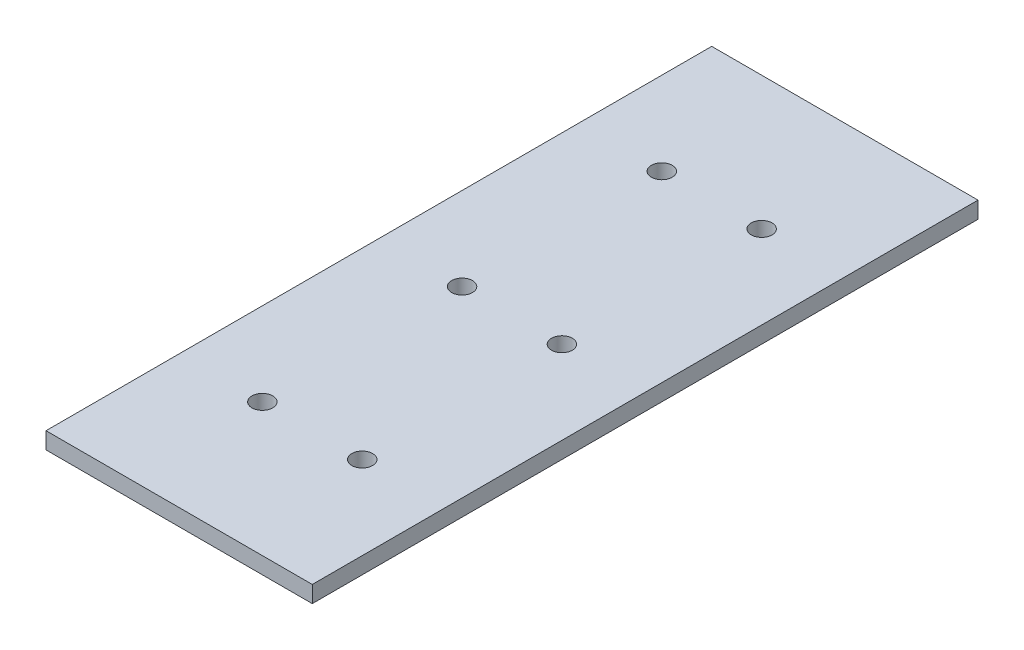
ISO-10303-21;
HEADER;
FILE_DESCRIPTION(('STEP AP214'),'2;1');
FILE_NAME('part.step','',(''),(''),'','','');
FILE_SCHEMA(('AUTOMOTIVE_DESIGN { 1 0 10303 214 1 1 1 1 }'));
ENDSEC;
DATA;
#1=APPLICATION_CONTEXT('core data for automotive mechanical design processes');
#2=APPLICATION_PROTOCOL_DEFINITION('international standard','automotive_design',2000,#1);
#3=PRODUCT_CONTEXT('',#1,'mechanical');
#4=PRODUCT('Part','Part','',(#3));
#5=PRODUCT_RELATED_PRODUCT_CATEGORY('part','',(#4));
#6=PRODUCT_DEFINITION_FORMATION('','',#4);
#7=PRODUCT_DEFINITION_CONTEXT('part definition',#1,'design');
#8=PRODUCT_DEFINITION('design','',#6,#7);
#9=PRODUCT_DEFINITION_SHAPE('','',#8);
#10=(LENGTH_UNIT() NAMED_UNIT(*) SI_UNIT(.MILLI.,.METRE.));
#11=(NAMED_UNIT(*) PLANE_ANGLE_UNIT() SI_UNIT($,.RADIAN.));
#12=(NAMED_UNIT(*) SI_UNIT($,.STERADIAN.) SOLID_ANGLE_UNIT());
#13=UNCERTAINTY_MEASURE_WITH_UNIT(LENGTH_MEASURE(1.E-05),#10,'distance_accuracy_value','');
#14=(GEOMETRIC_REPRESENTATION_CONTEXT(3) GLOBAL_UNCERTAINTY_ASSIGNED_CONTEXT((#13)) GLOBAL_UNIT_ASSIGNED_CONTEXT((#10,
#11,#12)) REPRESENTATION_CONTEXT('',''));
#15=CARTESIAN_POINT('',(0.,0.,0.));
#16=DIRECTION('',(0.,0.,1.));
#17=DIRECTION('',(1.,0.,0.));
#18=AXIS2_PLACEMENT_3D('',#15,#16,#17);
#19=CARTESIAN_POINT('',(-50.8,-3.17500000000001,254.));
#20=DIRECTION('',(1.,0.,0.));
#21=DIRECTION('',(0.,0.,-1.));
#22=AXIS2_PLACEMENT_3D('',#19,#20,#21);
#23=PLANE('',#22);
#24=DIRECTION('',(0.,-1.,0.));
#25=VECTOR('',#24,1.);
#26=CARTESIAN_POINT('',(-50.8,-3.17500000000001,0.));
#27=LINE('',#26,#25);
#28=CARTESIAN_POINT('',(-50.8,3.17499999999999,0.));
#29=VERTEX_POINT('',#28);
#30=CARTESIAN_POINT('',(-50.8,-3.17500000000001,0.));
#31=VERTEX_POINT('',#30);
#32=EDGE_CURVE('E95',#29,#31,#27,.T.);
#33=ORIENTED_EDGE('',*,*,#32,.T.);
#34=DIRECTION('',(0.,0.,-1.));
#35=VECTOR('',#34,1.);
#36=CARTESIAN_POINT('',(-50.8,-3.17500000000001,254.));
#37=LINE('',#36,#35);
#38=CARTESIAN_POINT('',(-50.8,-3.17500000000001,254.));
#39=VERTEX_POINT('',#38);
#40=EDGE_CURVE('E11',#39,#31,#37,.T.);
#41=ORIENTED_EDGE('',*,*,#40,.F.);
#42=DIRECTION('',(0.,-1.,0.));
#43=VECTOR('',#42,1.);
#44=CARTESIAN_POINT('',(-50.8,-3.17500000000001,254.));
#45=LINE('',#44,#43);
#46=CARTESIAN_POINT('',(-50.8,3.17499999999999,254.));
#47=VERTEX_POINT('',#46);
#48=EDGE_CURVE('E83',#47,#39,#45,.T.);
#49=ORIENTED_EDGE('',*,*,#48,.F.);
#50=DIRECTION('',(0.,0.,-1.));
#51=VECTOR('',#50,1.);
#52=CARTESIAN_POINT('',(-50.8,3.17499999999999,254.));
#53=LINE('',#52,#51);
#54=EDGE_CURVE('E91',#47,#29,#53,.T.);
#55=ORIENTED_EDGE('',*,*,#54,.T.);
#56=EDGE_LOOP('',(#33,#41,#49,#55));
#57=FACE_BOUND('',#56,.T.);
#58=ADVANCED_FACE('F32',(#57),#23,.F.);
#59=CARTESIAN_POINT('',(50.8,-3.17499999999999,254.));
#60=DIRECTION('',(0.,1.,0.));
#61=DIRECTION('',(-1.,0.,0.));
#62=AXIS2_PLACEMENT_3D('',#59,#60,#61);
#63=PLANE('',#62);
#64=CARTESIAN_POINT('',(19.05,-3.175,203.2));
#65=DIRECTION('',(0.,1.,0.));
#66=DIRECTION('',(-1.,0.,0.));
#67=AXIS2_PLACEMENT_3D('',#64,#65,#66);
#68=CIRCLE('',#67,3.97510000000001);
#69=CARTESIAN_POINT('',(15.0749,-3.175,203.2));
#70=VERTEX_POINT('',#69);
#71=EDGE_CURVE('E136',#70,#70,#68,.T.);
#72=ORIENTED_EDGE('',*,*,#71,.T.);
#73=EDGE_LOOP('',(#72));
#74=FACE_BOUND('',#73,.T.);
#75=CARTESIAN_POINT('',(-19.05,-3.175,203.2));
#76=DIRECTION('',(0.,1.,0.));
#77=DIRECTION('',(-1.,0.,0.));
#78=AXIS2_PLACEMENT_3D('',#75,#76,#77);
#79=CIRCLE('',#78,3.97510000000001);
#80=CARTESIAN_POINT('',(-23.0251,-3.175,203.2));
#81=VERTEX_POINT('',#80);
#82=EDGE_CURVE('E130',#81,#81,#79,.T.);
#83=ORIENTED_EDGE('',*,*,#82,.T.);
#84=EDGE_LOOP('',(#83));
#85=FACE_BOUND('',#84,.T.);
#86=CARTESIAN_POINT('',(19.05,-3.175,127.));
#87=DIRECTION('',(0.,1.,0.));
#88=DIRECTION('',(-1.,0.,0.));
#89=AXIS2_PLACEMENT_3D('',#86,#87,#88);
#90=CIRCLE('',#89,3.97510000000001);
#91=CARTESIAN_POINT('',(15.0749,-3.175,127.));
#92=VERTEX_POINT('',#91);
#93=EDGE_CURVE('E124',#92,#92,#90,.T.);
#94=ORIENTED_EDGE('',*,*,#93,.T.);
#95=EDGE_LOOP('',(#94));
#96=FACE_BOUND('',#95,.T.);
#97=CARTESIAN_POINT('',(-19.05,-3.175,127.));
#98=DIRECTION('',(0.,1.,0.));
#99=DIRECTION('',(-1.,0.,0.));
#100=AXIS2_PLACEMENT_3D('',#97,#98,#99);
#101=CIRCLE('',#100,3.97510000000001);
#102=CARTESIAN_POINT('',(-23.0251,-3.175,127.));
#103=VERTEX_POINT('',#102);
#104=EDGE_CURVE('E118',#103,#103,#101,.T.);
#105=ORIENTED_EDGE('',*,*,#104,.T.);
#106=EDGE_LOOP('',(#105));
#107=FACE_BOUND('',#106,.T.);
#108=CARTESIAN_POINT('',(19.05,-3.175,50.8));
#109=DIRECTION('',(0.,1.,0.));
#110=DIRECTION('',(-1.,0.,0.));
#111=AXIS2_PLACEMENT_3D('',#108,#109,#110);
#112=CIRCLE('',#111,3.9751);
#113=CARTESIAN_POINT('',(15.0749,-3.175,50.8));
#114=VERTEX_POINT('',#113);
#115=EDGE_CURVE('E112',#114,#114,#112,.T.);
#116=ORIENTED_EDGE('',*,*,#115,.T.);
#117=EDGE_LOOP('',(#116));
#118=FACE_BOUND('',#117,.T.);
#119=CARTESIAN_POINT('',(-19.05,-3.175,50.8));
#120=DIRECTION('',(0.,1.,0.));
#121=DIRECTION('',(-1.,0.,0.));
#122=AXIS2_PLACEMENT_3D('',#119,#120,#121);
#123=CIRCLE('',#122,3.9751);
#124=CARTESIAN_POINT('',(-23.0251,-3.175,50.8));
#125=VERTEX_POINT('',#124);
#126=EDGE_CURVE('E98',#125,#125,#123,.T.);
#127=ORIENTED_EDGE('',*,*,#126,.T.);
#128=EDGE_LOOP('',(#127));
#129=FACE_BOUND('',#128,.T.);
#130=DIRECTION('',(1.,0.,0.));
#131=VECTOR('',#130,1.);
#132=CARTESIAN_POINT('',(50.8,-3.17499999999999,0.));
#133=LINE('',#132,#131);
#134=CARTESIAN_POINT('',(50.8,-3.17499999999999,0.));
#135=VERTEX_POINT('',#134);
#136=EDGE_CURVE('E87',#31,#135,#133,.T.);
#137=ORIENTED_EDGE('',*,*,#136,.T.);
#138=DIRECTION('',(0.,0.,-1.));
#139=VECTOR('',#138,1.);
#140=CARTESIAN_POINT('',(50.8,-3.17499999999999,254.));
#141=LINE('',#140,#139);
#142=CARTESIAN_POINT('',(50.8,-3.17499999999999,254.));
#143=VERTEX_POINT('',#142);
#144=EDGE_CURVE('E40',#143,#135,#141,.T.);
#145=ORIENTED_EDGE('',*,*,#144,.F.);
#146=DIRECTION('',(1.,0.,0.));
#147=VECTOR('',#146,1.);
#148=CARTESIAN_POINT('',(50.8,-3.17499999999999,254.));
#149=LINE('',#148,#147);
#150=EDGE_CURVE('E78',#39,#143,#149,.T.);
#151=ORIENTED_EDGE('',*,*,#150,.F.);
#152=ORIENTED_EDGE('',*,*,#40,.T.);
#153=EDGE_LOOP('',(#137,#145,#151,#152));
#154=FACE_BOUND('',#153,.T.);
#155=ADVANCED_FACE('F86',(#74,#85,#96,#107,#118,#129,#154),#63,.F.);
#156=CARTESIAN_POINT('',(50.8,-3.17499999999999,254.));
#157=DIRECTION('',(-1.,0.,0.));
#158=DIRECTION('',(0.,0.,1.));
#159=AXIS2_PLACEMENT_3D('',#156,#157,#158);
#160=PLANE('',#159);
#161=DIRECTION('',(0.,1.,0.));
#162=VECTOR('',#161,1.);
#163=CARTESIAN_POINT('',(50.8,-3.17499999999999,0.));
#164=LINE('',#163,#162);
#165=CARTESIAN_POINT('',(50.8,3.17500000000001,0.));
#166=VERTEX_POINT('',#165);
#167=EDGE_CURVE('E65',#135,#166,#164,.T.);
#168=ORIENTED_EDGE('',*,*,#167,.T.);
#169=DIRECTION('',(0.,0.,-1.));
#170=VECTOR('',#169,1.);
#171=CARTESIAN_POINT('',(50.8,3.17500000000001,254.));
#172=LINE('',#171,#170);
#173=CARTESIAN_POINT('',(50.8,3.17500000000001,254.));
#174=VERTEX_POINT('',#173);
#175=EDGE_CURVE('E88',#174,#166,#172,.T.);
#176=ORIENTED_EDGE('',*,*,#175,.F.);
#177=DIRECTION('',(0.,1.,0.));
#178=VECTOR('',#177,1.);
#179=CARTESIAN_POINT('',(50.8,-3.17499999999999,254.));
#180=LINE('',#179,#178);
#181=EDGE_CURVE('E81',#143,#174,#180,.T.);
#182=ORIENTED_EDGE('',*,*,#181,.F.);
#183=ORIENTED_EDGE('',*,*,#144,.T.);
#184=EDGE_LOOP('',(#168,#176,#182,#183));
#185=FACE_BOUND('',#184,.T.);
#186=ADVANCED_FACE('F89',(#185),#160,.F.);
#187=CARTESIAN_POINT('',(50.8,3.17500000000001,254.));
#188=DIRECTION('',(0.,-1.,0.));
#189=DIRECTION('',(1.,0.,0.));
#190=AXIS2_PLACEMENT_3D('',#187,#188,#189);
#191=PLANE('',#190);
#192=CARTESIAN_POINT('',(19.05,3.175,203.2));
#193=DIRECTION('',(0.,1.,0.));
#194=DIRECTION('',(-1.,0.,0.));
#195=AXIS2_PLACEMENT_3D('',#192,#193,#194);
#196=CIRCLE('',#195,3.97510000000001);
#197=CARTESIAN_POINT('',(15.0749,3.175,203.2));
#198=VERTEX_POINT('',#197);
#199=EDGE_CURVE('E139',#198,#198,#196,.T.);
#200=ORIENTED_EDGE('',*,*,#199,.F.);
#201=EDGE_LOOP('',(#200));
#202=FACE_BOUND('',#201,.T.);
#203=CARTESIAN_POINT('',(-19.05,3.175,203.2));
#204=DIRECTION('',(0.,1.,0.));
#205=DIRECTION('',(-1.,0.,0.));
#206=AXIS2_PLACEMENT_3D('',#203,#204,#205);
#207=CIRCLE('',#206,3.97510000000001);
#208=CARTESIAN_POINT('',(-23.0251,3.175,203.2));
#209=VERTEX_POINT('',#208);
#210=EDGE_CURVE('E133',#209,#209,#207,.T.);
#211=ORIENTED_EDGE('',*,*,#210,.F.);
#212=EDGE_LOOP('',(#211));
#213=FACE_BOUND('',#212,.T.);
#214=CARTESIAN_POINT('',(19.05,3.175,127.));
#215=DIRECTION('',(0.,1.,0.));
#216=DIRECTION('',(-1.,0.,0.));
#217=AXIS2_PLACEMENT_3D('',#214,#215,#216);
#218=CIRCLE('',#217,3.97510000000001);
#219=CARTESIAN_POINT('',(15.0749,3.175,127.));
#220=VERTEX_POINT('',#219);
#221=EDGE_CURVE('E127',#220,#220,#218,.T.);
#222=ORIENTED_EDGE('',*,*,#221,.F.);
#223=EDGE_LOOP('',(#222));
#224=FACE_BOUND('',#223,.T.);
#225=CARTESIAN_POINT('',(-19.05,3.175,127.));
#226=DIRECTION('',(0.,1.,0.));
#227=DIRECTION('',(-1.,0.,0.));
#228=AXIS2_PLACEMENT_3D('',#225,#226,#227);
#229=CIRCLE('',#228,3.97510000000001);
#230=CARTESIAN_POINT('',(-23.0251,3.175,127.));
#231=VERTEX_POINT('',#230);
#232=EDGE_CURVE('E121',#231,#231,#229,.T.);
#233=ORIENTED_EDGE('',*,*,#232,.F.);
#234=EDGE_LOOP('',(#233));
#235=FACE_BOUND('',#234,.T.);
#236=CARTESIAN_POINT('',(19.05,3.175,50.8));
#237=DIRECTION('',(0.,1.,0.));
#238=DIRECTION('',(-1.,0.,0.));
#239=AXIS2_PLACEMENT_3D('',#236,#237,#238);
#240=CIRCLE('',#239,3.9751);
#241=CARTESIAN_POINT('',(15.0749,3.175,50.8));
#242=VERTEX_POINT('',#241);
#243=EDGE_CURVE('E115',#242,#242,#240,.T.);
#244=ORIENTED_EDGE('',*,*,#243,.F.);
#245=EDGE_LOOP('',(#244));
#246=FACE_BOUND('',#245,.T.);
#247=CARTESIAN_POINT('',(-19.05,3.175,50.8));
#248=DIRECTION('',(0.,1.,0.));
#249=DIRECTION('',(-1.,0.,0.));
#250=AXIS2_PLACEMENT_3D('',#247,#248,#249);
#251=CIRCLE('',#250,3.9751);
#252=CARTESIAN_POINT('',(-23.0251,3.175,50.8));
#253=VERTEX_POINT('',#252);
#254=EDGE_CURVE('E109',#253,#253,#251,.T.);
#255=ORIENTED_EDGE('',*,*,#254,.F.);
#256=EDGE_LOOP('',(#255));
#257=FACE_BOUND('',#256,.T.);
#258=DIRECTION('',(-1.,0.,0.));
#259=VECTOR('',#258,1.);
#260=CARTESIAN_POINT('',(50.8,3.17500000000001,0.));
#261=LINE('',#260,#259);
#262=EDGE_CURVE('E71',#166,#29,#261,.T.);
#263=ORIENTED_EDGE('',*,*,#262,.T.);
#264=ORIENTED_EDGE('',*,*,#54,.F.);
#265=DIRECTION('',(-1.,0.,0.));
#266=VECTOR('',#265,1.);
#267=CARTESIAN_POINT('',(50.8,3.17500000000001,254.));
#268=LINE('',#267,#266);
#269=EDGE_CURVE('E48',#174,#47,#268,.T.);
#270=ORIENTED_EDGE('',*,*,#269,.F.);
#271=ORIENTED_EDGE('',*,*,#175,.T.);
#272=EDGE_LOOP('',(#263,#264,#270,#271));
#273=FACE_BOUND('',#272,.T.);
#274=ADVANCED_FACE('F103',(#202,#213,#224,#235,#246,#257,#273),#191,.F.);
#275=CARTESIAN_POINT('',(-50.8,3.17499999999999,254.));
#276=DIRECTION('',(0.,0.,1.));
#277=DIRECTION('',(1.,0.,0.));
#278=AXIS2_PLACEMENT_3D('',#275,#276,#277);
#279=PLANE('',#278);
#280=ORIENTED_EDGE('',*,*,#48,.T.);
#281=ORIENTED_EDGE('',*,*,#150,.T.);
#282=ORIENTED_EDGE('',*,*,#181,.T.);
#283=ORIENTED_EDGE('',*,*,#269,.T.);
#284=EDGE_LOOP('',(#280,#281,#282,#283));
#285=FACE_BOUND('',#284,.T.);
#286=ADVANCED_FACE('F79',(#285),#279,.T.);
#287=CARTESIAN_POINT('',(-50.8,3.17499999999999,0.));
#288=DIRECTION('',(0.,0.,1.));
#289=DIRECTION('',(1.,0.,0.));
#290=AXIS2_PLACEMENT_3D('',#287,#288,#289);
#291=PLANE('',#290);
#292=ORIENTED_EDGE('',*,*,#32,.F.);
#293=ORIENTED_EDGE('',*,*,#262,.F.);
#294=ORIENTED_EDGE('',*,*,#167,.F.);
#295=ORIENTED_EDGE('',*,*,#136,.F.);
#296=EDGE_LOOP('',(#292,#293,#294,#295));
#297=FACE_BOUND('',#296,.T.);
#298=ADVANCED_FACE('F106',(#297),#291,.F.);
#299=CARTESIAN_POINT('',(-19.05,-3.175,50.8));
#300=DIRECTION('',(0.,1.,0.));
#301=DIRECTION('',(-1.,0.,0.));
#302=AXIS2_PLACEMENT_3D('',#299,#300,#301);
#303=CYLINDRICAL_SURFACE('',#302,3.9751);
#304=ORIENTED_EDGE('',*,*,#126,.F.);
#305=EDGE_LOOP('',(#304));
#306=FACE_BOUND('',#305,.T.);
#307=ORIENTED_EDGE('',*,*,#254,.T.);
#308=EDGE_LOOP('',(#307));
#309=FACE_BOUND('',#308,.T.);
#310=ADVANCED_FACE('F167',(#306,#309),#303,.F.);
#311=CARTESIAN_POINT('',(19.05,-3.175,50.8));
#312=DIRECTION('',(0.,1.,0.));
#313=DIRECTION('',(-1.,0.,0.));
#314=AXIS2_PLACEMENT_3D('',#311,#312,#313);
#315=CYLINDRICAL_SURFACE('',#314,3.9751);
#316=ORIENTED_EDGE('',*,*,#115,.F.);
#317=EDGE_LOOP('',(#316));
#318=FACE_BOUND('',#317,.T.);
#319=ORIENTED_EDGE('',*,*,#243,.T.);
#320=EDGE_LOOP('',(#319));
#321=FACE_BOUND('',#320,.T.);
#322=ADVANCED_FACE('F169',(#318,#321),#315,.F.);
#323=CARTESIAN_POINT('',(-19.05,-3.175,127.));
#324=DIRECTION('',(0.,1.,0.));
#325=DIRECTION('',(-1.,0.,0.));
#326=AXIS2_PLACEMENT_3D('',#323,#324,#325);
#327=CYLINDRICAL_SURFACE('',#326,3.97510000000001);
#328=ORIENTED_EDGE('',*,*,#104,.F.);
#329=EDGE_LOOP('',(#328));
#330=FACE_BOUND('',#329,.T.);
#331=ORIENTED_EDGE('',*,*,#232,.T.);
#332=EDGE_LOOP('',(#331));
#333=FACE_BOUND('',#332,.T.);
#334=ADVANCED_FACE('F176',(#330,#333),#327,.F.);
#335=CARTESIAN_POINT('',(19.05,-3.175,127.));
#336=DIRECTION('',(0.,1.,0.));
#337=DIRECTION('',(-1.,0.,0.));
#338=AXIS2_PLACEMENT_3D('',#335,#336,#337);
#339=CYLINDRICAL_SURFACE('',#338,3.97510000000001);
#340=ORIENTED_EDGE('',*,*,#93,.F.);
#341=EDGE_LOOP('',(#340));
#342=FACE_BOUND('',#341,.T.);
#343=ORIENTED_EDGE('',*,*,#221,.T.);
#344=EDGE_LOOP('',(#343));
#345=FACE_BOUND('',#344,.T.);
#346=ADVANCED_FACE('F229',(#342,#345),#339,.F.);
#347=CARTESIAN_POINT('',(-19.05,-3.175,203.2));
#348=DIRECTION('',(0.,1.,0.));
#349=DIRECTION('',(-1.,0.,0.));
#350=AXIS2_PLACEMENT_3D('',#347,#348,#349);
#351=CYLINDRICAL_SURFACE('',#350,3.97510000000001);
#352=ORIENTED_EDGE('',*,*,#82,.F.);
#353=EDGE_LOOP('',(#352));
#354=FACE_BOUND('',#353,.T.);
#355=ORIENTED_EDGE('',*,*,#210,.T.);
#356=EDGE_LOOP('',(#355));
#357=FACE_BOUND('',#356,.T.);
#358=ADVANCED_FACE('F150',(#354,#357),#351,.F.);
#359=CARTESIAN_POINT('',(19.05,-3.175,203.2));
#360=DIRECTION('',(0.,1.,0.));
#361=DIRECTION('',(-1.,0.,0.));
#362=AXIS2_PLACEMENT_3D('',#359,#360,#361);
#363=CYLINDRICAL_SURFACE('',#362,3.97510000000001);
#364=ORIENTED_EDGE('',*,*,#71,.F.);
#365=EDGE_LOOP('',(#364));
#366=FACE_BOUND('',#365,.T.);
#367=ORIENTED_EDGE('',*,*,#199,.T.);
#368=EDGE_LOOP('',(#367));
#369=FACE_BOUND('',#368,.T.);
#370=ADVANCED_FACE('F147',(#366,#369),#363,.F.);
#371=CLOSED_SHELL('',(#58,#155,#186,#274,#286,#298,#310,#322,#334,#346,#358,#370));
#372=MANIFOLD_SOLID_BREP('B2',#371);
#373=ADVANCED_BREP_SHAPE_REPRESENTATION('',(#18,#372),#14);
#374=SHAPE_DEFINITION_REPRESENTATION(#9,#373);
ENDSEC;
END-ISO-10303-21;
